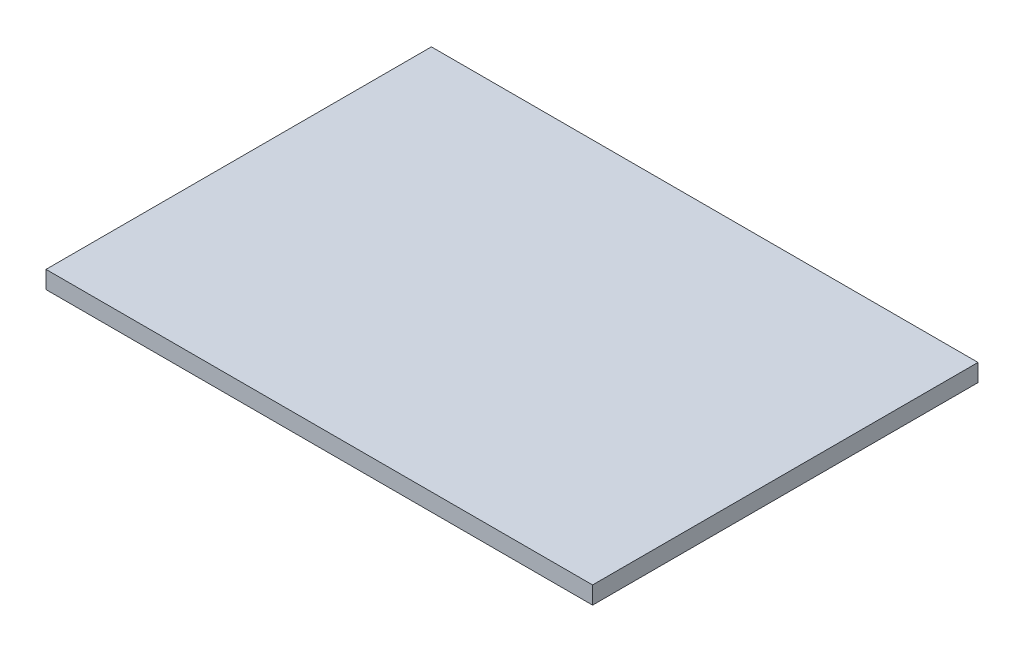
ISO-10303-21;
HEADER;
FILE_DESCRIPTION(('STEP AP214'),'2;1');
FILE_NAME('part.step','',(''),(''),'','','');
FILE_SCHEMA(('AUTOMOTIVE_DESIGN { 1 0 10303 214 1 1 1 1 }'));
ENDSEC;
DATA;
#1=APPLICATION_CONTEXT('core data for automotive mechanical design processes');
#2=APPLICATION_PROTOCOL_DEFINITION('international standard','automotive_design',2000,#1);
#3=PRODUCT_CONTEXT('',#1,'mechanical');
#4=PRODUCT('Part','Part','',(#3));
#5=PRODUCT_RELATED_PRODUCT_CATEGORY('part','',(#4));
#6=PRODUCT_DEFINITION_FORMATION('','',#4);
#7=PRODUCT_DEFINITION_CONTEXT('part definition',#1,'design');
#8=PRODUCT_DEFINITION('design','',#6,#7);
#9=PRODUCT_DEFINITION_SHAPE('','',#8);
#10=(LENGTH_UNIT() NAMED_UNIT(*) SI_UNIT(.MILLI.,.METRE.));
#11=(NAMED_UNIT(*) PLANE_ANGLE_UNIT() SI_UNIT($,.RADIAN.));
#12=(NAMED_UNIT(*) SI_UNIT($,.STERADIAN.) SOLID_ANGLE_UNIT());
#13=UNCERTAINTY_MEASURE_WITH_UNIT(LENGTH_MEASURE(1.E-05),#10,'distance_accuracy_value','');
#14=(GEOMETRIC_REPRESENTATION_CONTEXT(3) GLOBAL_UNCERTAINTY_ASSIGNED_CONTEXT((#13)) GLOBAL_UNIT_ASSIGNED_CONTEXT((#10,
#11,#12)) REPRESENTATION_CONTEXT('',''));
#15=CARTESIAN_POINT('',(0.,0.,0.));
#16=DIRECTION('',(0.,0.,1.));
#17=DIRECTION('',(1.,0.,0.));
#18=AXIS2_PLACEMENT_3D('',#15,#16,#17);
#19=CARTESIAN_POINT('',(205.844665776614,39.1997206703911,220.));
#20=DIRECTION('',(-1.,0.,0.));
#21=DIRECTION('',(0.,0.,1.));
#22=AXIS2_PLACEMENT_3D('',#19,#20,#21);
#23=PLANE('',#22);
#24=DIRECTION('',(0.,1.,0.));
#25=VECTOR('',#24,1.);
#26=CARTESIAN_POINT('',(205.844665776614,39.1997206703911,0.));
#27=LINE('',#26,#25);
#28=CARTESIAN_POINT('',(205.844665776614,39.1997206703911,0.));
#29=VERTEX_POINT('',#28);
#30=CARTESIAN_POINT('',(205.844665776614,49.1997206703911,0.));
#31=VERTEX_POINT('',#30);
#32=EDGE_CURVE('E95',#29,#31,#27,.T.);
#33=ORIENTED_EDGE('',*,*,#32,.T.);
#34=DIRECTION('',(0.,0.,-1.));
#35=VECTOR('',#34,1.);
#36=CARTESIAN_POINT('',(205.844665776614,49.1997206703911,220.));
#37=LINE('',#36,#35);
#38=CARTESIAN_POINT('',(205.844665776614,49.1997206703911,220.));
#39=VERTEX_POINT('',#38);
#40=EDGE_CURVE('E11',#39,#31,#37,.T.);
#41=ORIENTED_EDGE('',*,*,#40,.F.);
#42=DIRECTION('',(0.,1.,0.));
#43=VECTOR('',#42,1.);
#44=CARTESIAN_POINT('',(205.844665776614,39.1997206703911,220.));
#45=LINE('',#44,#43);
#46=CARTESIAN_POINT('',(205.844665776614,39.1997206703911,220.));
#47=VERTEX_POINT('',#46);
#48=EDGE_CURVE('E83',#47,#39,#45,.T.);
#49=ORIENTED_EDGE('',*,*,#48,.F.);
#50=DIRECTION('',(0.,0.,-1.));
#51=VECTOR('',#50,1.);
#52=CARTESIAN_POINT('',(205.844665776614,39.1997206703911,220.));
#53=LINE('',#52,#51);
#54=EDGE_CURVE('E91',#47,#29,#53,.T.);
#55=ORIENTED_EDGE('',*,*,#54,.T.);
#56=EDGE_LOOP('',(#33,#41,#49,#55));
#57=FACE_BOUND('',#56,.T.);
#58=ADVANCED_FACE('F32',(#57),#23,.F.);
#59=CARTESIAN_POINT('',(205.844665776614,49.1997206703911,220.));
#60=DIRECTION('',(0.,-1.,0.));
#61=DIRECTION('',(1.,0.,0.));
#62=AXIS2_PLACEMENT_3D('',#59,#60,#61);
#63=PLANE('',#62);
#64=DIRECTION('',(-1.,0.,0.));
#65=VECTOR('',#64,1.);
#66=CARTESIAN_POINT('',(205.844665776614,49.1997206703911,0.));
#67=LINE('',#66,#65);
#68=CARTESIAN_POINT('',(-106.155334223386,49.1997206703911,0.));
#69=VERTEX_POINT('',#68);
#70=EDGE_CURVE('E87',#31,#69,#67,.T.);
#71=ORIENTED_EDGE('',*,*,#70,.T.);
#72=DIRECTION('',(0.,0.,-1.));
#73=VECTOR('',#72,1.);
#74=CARTESIAN_POINT('',(-106.155334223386,49.1997206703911,220.));
#75=LINE('',#74,#73);
#76=CARTESIAN_POINT('',(-106.155334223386,49.1997206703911,220.));
#77=VERTEX_POINT('',#76);
#78=EDGE_CURVE('E40',#77,#69,#75,.T.);
#79=ORIENTED_EDGE('',*,*,#78,.F.);
#80=DIRECTION('',(-1.,0.,0.));
#81=VECTOR('',#80,1.);
#82=CARTESIAN_POINT('',(205.844665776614,49.1997206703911,220.));
#83=LINE('',#82,#81);
#84=EDGE_CURVE('E78',#39,#77,#83,.T.);
#85=ORIENTED_EDGE('',*,*,#84,.F.);
#86=ORIENTED_EDGE('',*,*,#40,.T.);
#87=EDGE_LOOP('',(#71,#79,#85,#86));
#88=FACE_BOUND('',#87,.T.);
#89=ADVANCED_FACE('F86',(#88),#63,.F.);
#90=CARTESIAN_POINT('',(-106.155334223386,39.1997206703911,220.));
#91=DIRECTION('',(1.,0.,0.));
#92=DIRECTION('',(0.,0.,-1.));
#93=AXIS2_PLACEMENT_3D('',#90,#91,#92);
#94=PLANE('',#93);
#95=DIRECTION('',(0.,-1.,0.));
#96=VECTOR('',#95,1.);
#97=CARTESIAN_POINT('',(-106.155334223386,39.1997206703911,0.));
#98=LINE('',#97,#96);
#99=CARTESIAN_POINT('',(-106.155334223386,39.1997206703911,0.));
#100=VERTEX_POINT('',#99);
#101=EDGE_CURVE('E65',#69,#100,#98,.T.);
#102=ORIENTED_EDGE('',*,*,#101,.T.);
#103=DIRECTION('',(0.,0.,-1.));
#104=VECTOR('',#103,1.);
#105=CARTESIAN_POINT('',(-106.155334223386,39.1997206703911,220.));
#106=LINE('',#105,#104);
#107=CARTESIAN_POINT('',(-106.155334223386,39.1997206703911,220.));
#108=VERTEX_POINT('',#107);
#109=EDGE_CURVE('E88',#108,#100,#106,.T.);
#110=ORIENTED_EDGE('',*,*,#109,.F.);
#111=DIRECTION('',(0.,-1.,0.));
#112=VECTOR('',#111,1.);
#113=CARTESIAN_POINT('',(-106.155334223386,39.1997206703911,220.));
#114=LINE('',#113,#112);
#115=EDGE_CURVE('E81',#77,#108,#114,.T.);
#116=ORIENTED_EDGE('',*,*,#115,.F.);
#117=ORIENTED_EDGE('',*,*,#78,.T.);
#118=EDGE_LOOP('',(#102,#110,#116,#117));
#119=FACE_BOUND('',#118,.T.);
#120=ADVANCED_FACE('F89',(#119),#94,.F.);
#121=CARTESIAN_POINT('',(205.844665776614,39.1997206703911,220.));
#122=DIRECTION('',(0.,1.,0.));
#123=DIRECTION('',(-1.,0.,0.));
#124=AXIS2_PLACEMENT_3D('',#121,#122,#123);
#125=PLANE('',#124);
#126=DIRECTION('',(1.,0.,0.));
#127=VECTOR('',#126,1.);
#128=CARTESIAN_POINT('',(205.844665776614,39.1997206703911,0.));
#129=LINE('',#128,#127);
#130=EDGE_CURVE('E71',#100,#29,#129,.T.);
#131=ORIENTED_EDGE('',*,*,#130,.T.);
#132=ORIENTED_EDGE('',*,*,#54,.F.);
#133=DIRECTION('',(1.,0.,0.));
#134=VECTOR('',#133,1.);
#135=CARTESIAN_POINT('',(205.844665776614,39.1997206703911,220.));
#136=LINE('',#135,#134);
#137=EDGE_CURVE('E48',#108,#47,#136,.T.);
#138=ORIENTED_EDGE('',*,*,#137,.F.);
#139=ORIENTED_EDGE('',*,*,#109,.T.);
#140=EDGE_LOOP('',(#131,#132,#138,#139));
#141=FACE_BOUND('',#140,.T.);
#142=ADVANCED_FACE('F102',(#141),#125,.F.);
#143=CARTESIAN_POINT('',(205.844665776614,49.1997206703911,220.));
#144=DIRECTION('',(0.,0.,1.));
#145=DIRECTION('',(1.,0.,0.));
#146=AXIS2_PLACEMENT_3D('',#143,#144,#145);
#147=PLANE('',#146);
#148=ORIENTED_EDGE('',*,*,#48,.T.);
#149=ORIENTED_EDGE('',*,*,#84,.T.);
#150=ORIENTED_EDGE('',*,*,#115,.T.);
#151=ORIENTED_EDGE('',*,*,#137,.T.);
#152=EDGE_LOOP('',(#148,#149,#150,#151));
#153=FACE_BOUND('',#152,.T.);
#154=ADVANCED_FACE('F79',(#153),#147,.T.);
#155=CARTESIAN_POINT('',(205.844665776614,49.1997206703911,0.));
#156=DIRECTION('',(0.,0.,1.));
#157=DIRECTION('',(1.,0.,0.));
#158=AXIS2_PLACEMENT_3D('',#155,#156,#157);
#159=PLANE('',#158);
#160=ORIENTED_EDGE('',*,*,#32,.F.);
#161=ORIENTED_EDGE('',*,*,#130,.F.);
#162=ORIENTED_EDGE('',*,*,#101,.F.);
#163=ORIENTED_EDGE('',*,*,#70,.F.);
#164=EDGE_LOOP('',(#160,#161,#162,#163));
#165=FACE_BOUND('',#164,.T.);
#166=ADVANCED_FACE('F105',(#165),#159,.F.);
#167=CLOSED_SHELL('',(#58,#89,#120,#142,#154,#166));
#168=MANIFOLD_SOLID_BREP('B2',#167);
#169=ADVANCED_BREP_SHAPE_REPRESENTATION('',(#18,#168),#14);
#170=SHAPE_DEFINITION_REPRESENTATION(#9,#169);
ENDSEC;
END-ISO-10303-21;
